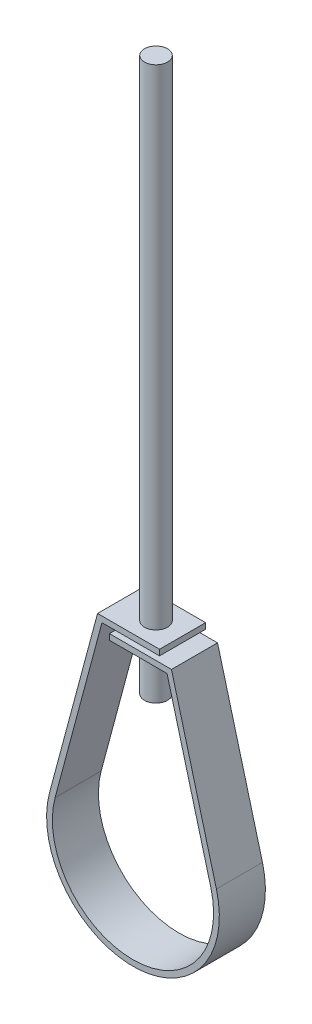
ISO-10303-21;
HEADER;
FILE_DESCRIPTION(('STEP AP214'),'2;1');
FILE_NAME('part.step','',(''),(''),'','','');
FILE_SCHEMA(('AUTOMOTIVE_DESIGN { 1 0 10303 214 1 1 1 1 }'));
ENDSEC;
DATA;
#1=APPLICATION_CONTEXT('core data for automotive mechanical design processes');
#2=APPLICATION_PROTOCOL_DEFINITION('international standard','automotive_design',2000,#1);
#3=PRODUCT_CONTEXT('',#1,'mechanical');
#4=PRODUCT('Part','Part','',(#3));
#5=PRODUCT_RELATED_PRODUCT_CATEGORY('part','',(#4));
#6=PRODUCT_DEFINITION_FORMATION('','',#4);
#7=PRODUCT_DEFINITION_CONTEXT('part definition',#1,'design');
#8=PRODUCT_DEFINITION('design','',#6,#7);
#9=PRODUCT_DEFINITION_SHAPE('','',#8);
#10=(LENGTH_UNIT() NAMED_UNIT(*) SI_UNIT(.MILLI.,.METRE.));
#11=(NAMED_UNIT(*) PLANE_ANGLE_UNIT() SI_UNIT($,.RADIAN.));
#12=(NAMED_UNIT(*) SI_UNIT($,.STERADIAN.) SOLID_ANGLE_UNIT());
#13=UNCERTAINTY_MEASURE_WITH_UNIT(LENGTH_MEASURE(1.E-05),#10,'distance_accuracy_value','');
#14=(GEOMETRIC_REPRESENTATION_CONTEXT(3) GLOBAL_UNCERTAINTY_ASSIGNED_CONTEXT((#13)) GLOBAL_UNIT_ASSIGNED_CONTEXT((#10,
#11,#12)) REPRESENTATION_CONTEXT('',''));
#15=CARTESIAN_POINT('',(0.,0.,0.));
#16=DIRECTION('',(0.,0.,1.));
#17=DIRECTION('',(1.,0.,0.));
#18=AXIS2_PLACEMENT_3D('',#15,#16,#17);
#19=CARTESIAN_POINT('',(-17.0929108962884,107.95,12.7));
#20=DIRECTION('',(0.,1.,0.));
#21=DIRECTION('',(0.,0.,1.));
#22=AXIS2_PLACEMENT_3D('',#19,#20,#21);
#23=PLANE('',#22);
#24=DIRECTION('',(1.,0.,0.));
#25=VECTOR('',#24,1.);
#26=CARTESIAN_POINT('',(-17.0929108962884,107.95,-12.7));
#27=LINE('',#26,#25);
#28=CARTESIAN_POINT('',(-17.0929108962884,107.95,-12.7));
#29=VERTEX_POINT('',#28);
#30=CARTESIAN_POINT('',(14.6570891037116,107.95,-12.7));
#31=VERTEX_POINT('',#30);
#32=EDGE_CURVE('E154',#29,#31,#27,.T.);
#33=ORIENTED_EDGE('',*,*,#32,.T.);
#34=DIRECTION('',(0.,0.,-1.));
#35=VECTOR('',#34,1.);
#36=CARTESIAN_POINT('',(14.6570891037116,107.95,12.7));
#37=LINE('',#36,#35);
#38=CARTESIAN_POINT('',(14.6570891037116,107.95,12.7));
#39=VERTEX_POINT('',#38);
#40=EDGE_CURVE('E200',#39,#31,#37,.T.);
#41=ORIENTED_EDGE('',*,*,#40,.F.);
#42=DIRECTION('',(1.,0.,0.));
#43=VECTOR('',#42,1.);
#44=CARTESIAN_POINT('',(-17.0929108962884,107.95,12.7));
#45=LINE('',#44,#43);
#46=CARTESIAN_POINT('',(-17.0929108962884,107.95,12.7));
#47=VERTEX_POINT('',#46);
#48=EDGE_CURVE('E102',#47,#39,#45,.T.);
#49=ORIENTED_EDGE('',*,*,#48,.F.);
#50=DIRECTION('',(0.,0.,-1.));
#51=VECTOR('',#50,1.);
#52=CARTESIAN_POINT('',(-17.0929108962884,107.95,12.7));
#53=LINE('',#52,#51);
#54=EDGE_CURVE('E150',#47,#29,#53,.T.);
#55=ORIENTED_EDGE('',*,*,#54,.T.);
#56=EDGE_LOOP('',(#33,#41,#49,#55));
#57=FACE_BOUND('',#56,.T.);
#58=CARTESIAN_POINT('',(0.,107.95,0.));
#59=DIRECTION('',(0.,1.,0.));
#60=DIRECTION('',(0.,0.,1.));
#61=AXIS2_PLACEMENT_3D('',#58,#59,#60);
#62=CIRCLE('',#61,6.35);
#63=CARTESIAN_POINT('',(0.,107.95,6.35));
#64=VERTEX_POINT('',#63);
#65=EDGE_CURVE('E11',#64,#64,#62,.F.);
#66=ORIENTED_EDGE('',*,*,#65,.F.);
#67=EDGE_LOOP('',(#66));
#68=FACE_BOUND('',#67,.T.);
#69=ADVANCED_FACE('F32',(#57,#68),#23,.F.);
#70=CARTESIAN_POINT('',(-17.0929108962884,111.125,12.7));
#71=DIRECTION('',(0.,1.,0.));
#72=DIRECTION('',(0.,0.,1.));
#73=AXIS2_PLACEMENT_3D('',#70,#71,#72);
#74=PLANE('',#73);
#75=DIRECTION('',(1.,0.,0.));
#76=VECTOR('',#75,1.);
#77=CARTESIAN_POINT('',(-17.0929108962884,111.125,-12.7));
#78=LINE('',#77,#76);
#79=CARTESIAN_POINT('',(-19.5291740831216,111.125,-12.7));
#80=VERTEX_POINT('',#79);
#81=CARTESIAN_POINT('',(14.6570891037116,111.125,-12.7));
#82=VERTEX_POINT('',#81);
#83=EDGE_CURVE('E161',#80,#82,#78,.T.);
#84=ORIENTED_EDGE('',*,*,#83,.F.);
#85=DIRECTION('',(0.,0.,-1.));
#86=VECTOR('',#85,1.);
#87=CARTESIAN_POINT('',(-19.5291740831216,111.125,12.7));
#88=LINE('',#87,#86);
#89=CARTESIAN_POINT('',(-19.5291740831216,111.125,12.7));
#90=VERTEX_POINT('',#89);
#91=EDGE_CURVE('E197',#90,#80,#88,.T.);
#92=ORIENTED_EDGE('',*,*,#91,.F.);
#93=DIRECTION('',(1.,0.,0.));
#94=VECTOR('',#93,1.);
#95=CARTESIAN_POINT('',(-17.0929108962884,111.125,12.7));
#96=LINE('',#95,#94);
#97=CARTESIAN_POINT('',(14.6570891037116,111.125,12.7));
#98=VERTEX_POINT('',#97);
#99=EDGE_CURVE('E301',#90,#98,#96,.T.);
#100=ORIENTED_EDGE('',*,*,#99,.T.);
#101=DIRECTION('',(0.,0.,-1.));
#102=VECTOR('',#101,1.);
#103=CARTESIAN_POINT('',(14.6570891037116,111.125,12.7));
#104=LINE('',#103,#102);
#105=EDGE_CURVE('E199',#98,#82,#104,.T.);
#106=ORIENTED_EDGE('',*,*,#105,.T.);
#107=EDGE_LOOP('',(#84,#92,#100,#106));
#108=FACE_BOUND('',#107,.T.);
#109=CARTESIAN_POINT('',(0.,111.125,0.));
#110=DIRECTION('',(0.,1.,0.));
#111=DIRECTION('',(0.,0.,1.));
#112=AXIS2_PLACEMENT_3D('',#109,#110,#111);
#113=CIRCLE('',#112,6.35);
#114=CARTESIAN_POINT('',(0.,111.125,6.35));
#115=VERTEX_POINT('',#114);
#116=EDGE_CURVE('E158',#115,#115,#113,.F.);
#117=ORIENTED_EDGE('',*,*,#116,.T.);
#118=EDGE_LOOP('',(#117));
#119=FACE_BOUND('',#118,.T.);
#120=ADVANCED_FACE('F220',(#108,#119),#74,.T.);
#121=CARTESIAN_POINT('',(-12.9556117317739,104.775,12.7));
#122=DIRECTION('',(0.,1.,0.));
#123=DIRECTION('',(0.,0.,1.));
#124=AXIS2_PLACEMENT_3D('',#121,#122,#123);
#125=PLANE('',#124);
#126=DIRECTION('',(1.,0.,0.));
#127=VECTOR('',#126,1.);
#128=CARTESIAN_POINT('',(-12.9556117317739,104.775,-12.7));
#129=LINE('',#128,#127);
#130=CARTESIAN_POINT('',(-12.9556117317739,104.775,-12.7));
#131=VERTEX_POINT('',#130);
#132=CARTESIAN_POINT('',(21.2306514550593,104.775,-12.7));
#133=VERTEX_POINT('',#132);
#134=EDGE_CURVE('E173',#131,#133,#129,.T.);
#135=ORIENTED_EDGE('',*,*,#134,.F.);
#136=DIRECTION('',(0.,0.,-1.));
#137=VECTOR('',#136,1.);
#138=CARTESIAN_POINT('',(-12.9556117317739,104.775,12.7));
#139=LINE('',#138,#137);
#140=CARTESIAN_POINT('',(-12.9556117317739,104.775,12.7));
#141=VERTEX_POINT('',#140);
#142=EDGE_CURVE('E189',#141,#131,#139,.T.);
#143=ORIENTED_EDGE('',*,*,#142,.F.);
#144=DIRECTION('',(1.,0.,0.));
#145=VECTOR('',#144,1.);
#146=CARTESIAN_POINT('',(-12.9556117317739,104.775,12.7));
#147=LINE('',#146,#145);
#148=CARTESIAN_POINT('',(21.2306514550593,104.775,12.7));
#149=VERTEX_POINT('',#148);
#150=EDGE_CURVE('E299',#141,#149,#147,.T.);
#151=ORIENTED_EDGE('',*,*,#150,.T.);
#152=DIRECTION('',(0.,0.,-1.));
#153=VECTOR('',#152,1.);
#154=CARTESIAN_POINT('',(21.2306514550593,104.775,12.7));
#155=LINE('',#154,#153);
#156=EDGE_CURVE('E191',#149,#133,#155,.T.);
#157=ORIENTED_EDGE('',*,*,#156,.T.);
#158=EDGE_LOOP('',(#135,#143,#151,#157));
#159=FACE_BOUND('',#158,.T.);
#160=CARTESIAN_POINT('',(0.,104.775,0.));
#161=DIRECTION('',(0.,1.,0.));
#162=DIRECTION('',(0.,0.,1.));
#163=AXIS2_PLACEMENT_3D('',#160,#161,#162);
#164=CIRCLE('',#163,6.35);
#165=CARTESIAN_POINT('',(0.,104.775,6.35));
#166=VERTEX_POINT('',#165);
#167=EDGE_CURVE('E322',#166,#166,#164,.F.);
#168=ORIENTED_EDGE('',*,*,#167,.T.);
#169=EDGE_LOOP('',(#168));
#170=FACE_BOUND('',#169,.T.);
#171=ADVANCED_FACE('F212',(#159,#170),#125,.T.);
#172=CARTESIAN_POINT('',(-12.9556117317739,101.6,12.7));
#173=DIRECTION('',(0.,1.,0.));
#174=DIRECTION('',(0.,0.,1.));
#175=AXIS2_PLACEMENT_3D('',#172,#173,#174);
#176=PLANE('',#175);
#177=DIRECTION('',(1.,0.,0.));
#178=VECTOR('',#177,1.);
#179=CARTESIAN_POINT('',(-12.9556117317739,101.6,-12.7));
#180=LINE('',#179,#178);
#181=CARTESIAN_POINT('',(-12.9556117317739,101.6,-12.7));
#182=VERTEX_POINT('',#181);
#183=CARTESIAN_POINT('',(18.7943882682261,101.6,-12.7));
#184=VERTEX_POINT('',#183);
#185=EDGE_CURVE('E179',#182,#184,#180,.T.);
#186=ORIENTED_EDGE('',*,*,#185,.T.);
#187=DIRECTION('',(0.,0.,-1.));
#188=VECTOR('',#187,1.);
#189=CARTESIAN_POINT('',(18.7943882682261,101.6,12.7));
#190=LINE('',#189,#188);
#191=CARTESIAN_POINT('',(18.7943882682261,101.6,12.7));
#192=VERTEX_POINT('',#191);
#193=EDGE_CURVE('E145',#192,#184,#190,.T.);
#194=ORIENTED_EDGE('',*,*,#193,.F.);
#195=DIRECTION('',(1.,0.,0.));
#196=VECTOR('',#195,1.);
#197=CARTESIAN_POINT('',(-12.9556117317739,101.6,12.7));
#198=LINE('',#197,#196);
#199=CARTESIAN_POINT('',(-12.9556117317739,101.6,12.7));
#200=VERTEX_POINT('',#199);
#201=EDGE_CURVE('E136',#200,#192,#198,.T.);
#202=ORIENTED_EDGE('',*,*,#201,.F.);
#203=DIRECTION('',(0.,0.,-1.));
#204=VECTOR('',#203,1.);
#205=CARTESIAN_POINT('',(-12.9556117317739,101.6,12.7));
#206=LINE('',#205,#204);
#207=EDGE_CURVE('E187',#200,#182,#206,.T.);
#208=ORIENTED_EDGE('',*,*,#207,.T.);
#209=EDGE_LOOP('',(#186,#194,#202,#208));
#210=FACE_BOUND('',#209,.T.);
#211=CARTESIAN_POINT('',(0.,101.6,0.));
#212=DIRECTION('',(0.,1.,0.));
#213=DIRECTION('',(0.,0.,1.));
#214=AXIS2_PLACEMENT_3D('',#211,#212,#213);
#215=CIRCLE('',#214,6.35);
#216=CARTESIAN_POINT('',(0.,101.6,6.35));
#217=VERTEX_POINT('',#216);
#218=EDGE_CURVE('E35',#217,#217,#215,.F.);
#219=ORIENTED_EDGE('',*,*,#218,.F.);
#220=EDGE_LOOP('',(#219));
#221=FACE_BOUND('',#220,.T.);
#222=ADVANCED_FACE('F209',(#210,#221),#176,.F.);
#223=CARTESIAN_POINT('',(14.6570891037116,111.125,12.7));
#224=DIRECTION('',(1.,0.,0.));
#225=DIRECTION('',(0.,0.,-1.));
#226=AXIS2_PLACEMENT_3D('',#223,#224,#225);
#227=PLANE('',#226);
#228=DIRECTION('',(0.,-1.,0.));
#229=VECTOR('',#228,1.);
#230=CARTESIAN_POINT('',(14.6570891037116,111.125,-12.7));
#231=LINE('',#230,#229);
#232=EDGE_CURVE('E157',#82,#31,#231,.T.);
#233=ORIENTED_EDGE('',*,*,#232,.F.);
#234=ORIENTED_EDGE('',*,*,#105,.F.);
#235=DIRECTION('',(0.,-1.,0.));
#236=VECTOR('',#235,1.);
#237=CARTESIAN_POINT('',(14.6570891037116,111.125,12.7));
#238=LINE('',#237,#236);
#239=EDGE_CURVE('E313',#98,#39,#238,.T.);
#240=ORIENTED_EDGE('',*,*,#239,.T.);
#241=ORIENTED_EDGE('',*,*,#40,.T.);
#242=EDGE_LOOP('',(#233,#234,#240,#241));
#243=FACE_BOUND('',#242,.T.);
#244=ADVANCED_FACE('F211',(#243),#227,.T.);
#245=CARTESIAN_POINT('',(-46.0022174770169,12.3262570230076,12.7));
#246=DIRECTION('',(-0.965925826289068,0.258819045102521,0.));
#247=DIRECTION('',(-0.258819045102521,-0.965925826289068,0.));
#248=AXIS2_PLACEMENT_3D('',#245,#246,#247);
#249=PLANE('',#248);
#250=DIRECTION('',(0.258819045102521,0.965925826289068,0.));
#251=VECTOR('',#250,1.);
#252=CARTESIAN_POINT('',(-46.0022174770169,12.3262570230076,-12.7));
#253=LINE('',#252,#251);
#254=CARTESIAN_POINT('',(-46.0022174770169,12.3262570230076,-12.7));
#255=VERTEX_POINT('',#254);
#256=EDGE_CURVE('E164',#255,#80,#253,.T.);
#257=ORIENTED_EDGE('',*,*,#256,.F.);
#258=DIRECTION('',(0.,0.,-1.));
#259=VECTOR('',#258,1.);
#260=CARTESIAN_POINT('',(-46.0022174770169,12.3262570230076,12.7));
#261=LINE('',#260,#259);
#262=CARTESIAN_POINT('',(-46.0022174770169,12.3262570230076,12.7));
#263=VERTEX_POINT('',#262);
#264=EDGE_CURVE('E195',#263,#255,#261,.T.);
#265=ORIENTED_EDGE('',*,*,#264,.F.);
#266=DIRECTION('',(0.258819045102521,0.965925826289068,0.));
#267=VECTOR('',#266,1.);
#268=CARTESIAN_POINT('',(-46.0022174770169,12.3262570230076,12.7));
#269=LINE('',#268,#267);
#270=EDGE_CURVE('E297',#263,#90,#269,.T.);
#271=ORIENTED_EDGE('',*,*,#270,.T.);
#272=ORIENTED_EDGE('',*,*,#91,.T.);
#273=EDGE_LOOP('',(#257,#265,#271,#272));
#274=FACE_BOUND('',#273,.T.);
#275=ADVANCED_FACE('F219',(#274),#249,.T.);
#276=CARTESIAN_POINT('',(0.,0.,12.7));
#277=DIRECTION('',(0.,0.,-1.));
#278=DIRECTION('',(-1.,0.,0.));
#279=AXIS2_PLACEMENT_3D('',#276,#277,#278);
#280=CYLINDRICAL_SURFACE('',#279,47.625);
#281=CARTESIAN_POINT('',(0.,0.,-12.7));
#282=DIRECTION('',(0.,0.,1.));
#283=DIRECTION('',(1.,0.,0.));
#284=AXIS2_PLACEMENT_3D('',#281,#282,#283);
#285=CIRCLE('',#284,47.625);
#286=CARTESIAN_POINT('',(46.0022174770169,12.3262570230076,-12.7));
#287=VERTEX_POINT('',#286);
#288=EDGE_CURVE('E167',#287,#255,#285,.F.);
#289=ORIENTED_EDGE('',*,*,#288,.F.);
#290=DIRECTION('',(0.,0.,-1.));
#291=VECTOR('',#290,1.);
#292=CARTESIAN_POINT('',(46.0022174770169,12.3262570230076,12.7));
#293=LINE('',#292,#291);
#294=CARTESIAN_POINT('',(46.0022174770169,12.3262570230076,12.7));
#295=VERTEX_POINT('',#294);
#296=EDGE_CURVE('E193',#295,#287,#293,.T.);
#297=ORIENTED_EDGE('',*,*,#296,.F.);
#298=CARTESIAN_POINT('',(0.,0.,12.7));
#299=DIRECTION('',(0.,0.,1.));
#300=DIRECTION('',(1.,0.,0.));
#301=AXIS2_PLACEMENT_3D('',#298,#299,#300);
#302=CIRCLE('',#301,47.625);
#303=EDGE_CURVE('E293',#295,#263,#302,.F.);
#304=ORIENTED_EDGE('',*,*,#303,.T.);
#305=ORIENTED_EDGE('',*,*,#264,.T.);
#306=EDGE_LOOP('',(#289,#297,#304,#305));
#307=FACE_BOUND('',#306,.T.);
#308=ADVANCED_FACE('F273',(#307),#280,.T.);
#309=CARTESIAN_POINT('',(21.8612027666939,102.421750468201,12.7));
#310=DIRECTION('',(0.965925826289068,0.258819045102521,0.));
#311=DIRECTION('',(-0.258819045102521,0.965925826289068,0.));
#312=AXIS2_PLACEMENT_3D('',#309,#310,#311);
#313=PLANE('',#312);
#314=DIRECTION('',(0.258819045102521,-0.965925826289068,0.));
#315=VECTOR('',#314,1.);
#316=CARTESIAN_POINT('',(21.8612027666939,102.421750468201,-12.7));
#317=LINE('',#316,#315);
#318=EDGE_CURVE('E170',#133,#287,#317,.T.);
#319=ORIENTED_EDGE('',*,*,#318,.F.);
#320=ORIENTED_EDGE('',*,*,#156,.F.);
#321=DIRECTION('',(0.258819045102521,-0.965925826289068,0.));
#322=VECTOR('',#321,1.);
#323=CARTESIAN_POINT('',(21.8612027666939,102.421750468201,12.7));
#324=LINE('',#323,#322);
#325=EDGE_CURVE('E296',#149,#295,#324,.T.);
#326=ORIENTED_EDGE('',*,*,#325,.T.);
#327=ORIENTED_EDGE('',*,*,#296,.T.);
#328=EDGE_LOOP('',(#319,#320,#326,#327));
#329=FACE_BOUND('',#328,.T.);
#330=ADVANCED_FACE('F268',(#329),#313,.T.);
#331=CARTESIAN_POINT('',(-12.9556117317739,101.6,12.7));
#332=DIRECTION('',(-1.,0.,0.));
#333=DIRECTION('',(0.,0.,1.));
#334=AXIS2_PLACEMENT_3D('',#331,#332,#333);
#335=PLANE('',#334);
#336=DIRECTION('',(0.,1.,0.));
#337=VECTOR('',#336,1.);
#338=CARTESIAN_POINT('',(-12.9556117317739,101.6,-12.7));
#339=LINE('',#338,#337);
#340=EDGE_CURVE('E176',#182,#131,#339,.T.);
#341=ORIENTED_EDGE('',*,*,#340,.F.);
#342=ORIENTED_EDGE('',*,*,#207,.F.);
#343=DIRECTION('',(0.,1.,0.));
#344=VECTOR('',#343,1.);
#345=CARTESIAN_POINT('',(-12.9556117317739,101.6,12.7));
#346=LINE('',#345,#344);
#347=EDGE_CURVE('E307',#200,#141,#346,.T.);
#348=ORIENTED_EDGE('',*,*,#347,.T.);
#349=ORIENTED_EDGE('',*,*,#142,.T.);
#350=EDGE_LOOP('',(#341,#342,#348,#349));
#351=FACE_BOUND('',#350,.T.);
#352=ADVANCED_FACE('F264',(#351),#335,.T.);
#353=CARTESIAN_POINT('',(18.7943882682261,101.6,12.7));
#354=DIRECTION('',(0.965925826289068,0.258819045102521,0.));
#355=DIRECTION('',(-0.258819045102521,0.965925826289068,0.));
#356=AXIS2_PLACEMENT_3D('',#353,#354,#355);
#357=PLANE('',#356);
#358=DIRECTION('',(0.258819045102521,-0.965925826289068,0.));
#359=VECTOR('',#358,1.);
#360=CARTESIAN_POINT('',(18.7943882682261,101.6,-12.7));
#361=LINE('',#360,#359);
#362=CARTESIAN_POINT('',(42.9354029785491,11.5045065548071,-12.7));
#363=VERTEX_POINT('',#362);
#364=EDGE_CURVE('E144',#184,#363,#361,.T.);
#365=ORIENTED_EDGE('',*,*,#364,.T.);
#366=DIRECTION('',(0.,0.,-1.));
#367=VECTOR('',#366,1.);
#368=CARTESIAN_POINT('',(42.9354029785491,11.5045065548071,12.7));
#369=LINE('',#368,#367);
#370=CARTESIAN_POINT('',(42.9354029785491,11.5045065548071,12.7));
#371=VERTEX_POINT('',#370);
#372=EDGE_CURVE('E141',#371,#363,#369,.T.);
#373=ORIENTED_EDGE('',*,*,#372,.F.);
#374=DIRECTION('',(0.258819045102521,-0.965925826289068,0.));
#375=VECTOR('',#374,1.);
#376=CARTESIAN_POINT('',(18.7943882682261,101.6,12.7));
#377=LINE('',#376,#375);
#378=EDGE_CURVE('E129',#192,#371,#377,.T.);
#379=ORIENTED_EDGE('',*,*,#378,.F.);
#380=ORIENTED_EDGE('',*,*,#193,.T.);
#381=EDGE_LOOP('',(#365,#373,#379,#380));
#382=FACE_BOUND('',#381,.T.);
#383=ADVANCED_FACE('F142',(#382),#357,.F.);
#384=CARTESIAN_POINT('',(0.,0.,12.7));
#385=DIRECTION('',(0.,0.,-1.));
#386=DIRECTION('',(-1.,0.,0.));
#387=AXIS2_PLACEMENT_3D('',#384,#385,#386);
#388=CYLINDRICAL_SURFACE('',#387,44.45);
#389=CARTESIAN_POINT('',(0.,0.,-12.7));
#390=DIRECTION('',(0.,0.,-1.));
#391=DIRECTION('',(-1.,0.,0.));
#392=AXIS2_PLACEMENT_3D('',#389,#390,#391);
#393=CIRCLE('',#392,44.45);
#394=CARTESIAN_POINT('',(-42.9354029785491,11.5045065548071,-12.7));
#395=VERTEX_POINT('',#394);
#396=EDGE_CURVE('E90',#363,#395,#393,.T.);
#397=ORIENTED_EDGE('',*,*,#396,.T.);
#398=DIRECTION('',(0.,0.,-1.));
#399=VECTOR('',#398,1.);
#400=CARTESIAN_POINT('',(-42.9354029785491,11.5045065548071,12.7));
#401=LINE('',#400,#399);
#402=CARTESIAN_POINT('',(-42.9354029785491,11.5045065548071,12.7));
#403=VERTEX_POINT('',#402);
#404=EDGE_CURVE('E146',#403,#395,#401,.T.);
#405=ORIENTED_EDGE('',*,*,#404,.F.);
#406=CARTESIAN_POINT('',(0.,0.,12.7));
#407=DIRECTION('',(0.,0.,-1.));
#408=DIRECTION('',(-1.,0.,0.));
#409=AXIS2_PLACEMENT_3D('',#406,#407,#408);
#410=CIRCLE('',#409,44.45);
#411=EDGE_CURVE('E133',#371,#403,#410,.T.);
#412=ORIENTED_EDGE('',*,*,#411,.F.);
#413=ORIENTED_EDGE('',*,*,#372,.T.);
#414=EDGE_LOOP('',(#397,#405,#412,#413));
#415=FACE_BOUND('',#414,.T.);
#416=ADVANCED_FACE('F148',(#415),#388,.F.);
#417=CARTESIAN_POINT('',(-42.9354029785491,11.5045065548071,12.7));
#418=DIRECTION('',(-0.965925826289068,0.258819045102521,0.));
#419=DIRECTION('',(-0.258819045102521,-0.965925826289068,0.));
#420=AXIS2_PLACEMENT_3D('',#417,#418,#419);
#421=PLANE('',#420);
#422=DIRECTION('',(0.258819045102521,0.965925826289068,0.));
#423=VECTOR('',#422,1.);
#424=CARTESIAN_POINT('',(-42.9354029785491,11.5045065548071,-12.7));
#425=LINE('',#424,#423);
#426=EDGE_CURVE('E96',#395,#29,#425,.T.);
#427=ORIENTED_EDGE('',*,*,#426,.T.);
#428=ORIENTED_EDGE('',*,*,#54,.F.);
#429=DIRECTION('',(0.258819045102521,0.965925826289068,0.));
#430=VECTOR('',#429,1.);
#431=CARTESIAN_POINT('',(-42.9354029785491,11.5045065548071,12.7));
#432=LINE('',#431,#430);
#433=EDGE_CURVE('E49',#403,#47,#432,.T.);
#434=ORIENTED_EDGE('',*,*,#433,.F.);
#435=ORIENTED_EDGE('',*,*,#404,.T.);
#436=EDGE_LOOP('',(#427,#428,#434,#435));
#437=FACE_BOUND('',#436,.T.);
#438=ADVANCED_FACE('F256',(#437),#421,.F.);
#439=CARTESIAN_POINT('',(0.,0.,12.7));
#440=DIRECTION('',(0.,0.,1.));
#441=DIRECTION('',(1.,0.,0.));
#442=AXIS2_PLACEMENT_3D('',#439,#440,#441);
#443=PLANE('',#442);
#444=ORIENTED_EDGE('',*,*,#48,.T.);
#445=ORIENTED_EDGE('',*,*,#239,.F.);
#446=ORIENTED_EDGE('',*,*,#99,.F.);
#447=ORIENTED_EDGE('',*,*,#270,.F.);
#448=ORIENTED_EDGE('',*,*,#303,.F.);
#449=ORIENTED_EDGE('',*,*,#325,.F.);
#450=ORIENTED_EDGE('',*,*,#150,.F.);
#451=ORIENTED_EDGE('',*,*,#347,.F.);
#452=ORIENTED_EDGE('',*,*,#201,.T.);
#453=ORIENTED_EDGE('',*,*,#378,.T.);
#454=ORIENTED_EDGE('',*,*,#411,.T.);
#455=ORIENTED_EDGE('',*,*,#433,.T.);
#456=EDGE_LOOP('',(#444,#445,#446,#447,#448,#449,#450,#451,#452,#453,#454,#455));
#457=FACE_BOUND('',#456,.T.);
#458=ADVANCED_FACE('F131',(#457),#443,.T.);
#459=CARTESIAN_POINT('',(0.,0.,-12.7));
#460=DIRECTION('',(0.,0.,1.));
#461=DIRECTION('',(1.,0.,0.));
#462=AXIS2_PLACEMENT_3D('',#459,#460,#461);
#463=PLANE('',#462);
#464=ORIENTED_EDGE('',*,*,#32,.F.);
#465=ORIENTED_EDGE('',*,*,#426,.F.);
#466=ORIENTED_EDGE('',*,*,#396,.F.);
#467=ORIENTED_EDGE('',*,*,#364,.F.);
#468=ORIENTED_EDGE('',*,*,#185,.F.);
#469=ORIENTED_EDGE('',*,*,#340,.T.);
#470=ORIENTED_EDGE('',*,*,#134,.T.);
#471=ORIENTED_EDGE('',*,*,#318,.T.);
#472=ORIENTED_EDGE('',*,*,#288,.T.);
#473=ORIENTED_EDGE('',*,*,#256,.T.);
#474=ORIENTED_EDGE('',*,*,#83,.T.);
#475=ORIENTED_EDGE('',*,*,#232,.T.);
#476=EDGE_LOOP('',(#464,#465,#466,#467,#468,#469,#470,#471,#472,#473,#474,#475));
#477=FACE_BOUND('',#476,.T.);
#478=ADVANCED_FACE('F255',(#477),#463,.F.);
#479=CARTESIAN_POINT('',(0.,76.2,0.));
#480=DIRECTION('',(0.,1.,0.));
#481=DIRECTION('',(0.,0.,1.));
#482=AXIS2_PLACEMENT_3D('',#479,#480,#481);
#483=PLANE('',#482);
#484=CARTESIAN_POINT('',(0.,76.2,0.));
#485=DIRECTION('',(0.,1.,0.));
#486=DIRECTION('',(0.,0.,1.));
#487=AXIS2_PLACEMENT_3D('',#484,#485,#486);
#488=CIRCLE('',#487,6.35);
#489=CARTESIAN_POINT('',(0.,76.2,6.35));
#490=VERTEX_POINT('',#489);
#491=EDGE_CURVE('E328',#490,#490,#488,.T.);
#492=ORIENTED_EDGE('',*,*,#491,.F.);
#493=EDGE_LOOP('',(#492));
#494=FACE_BOUND('',#493,.T.);
#495=ADVANCED_FACE('F247',(#494),#483,.F.);
#496=CARTESIAN_POINT('',(0.,381.,0.));
#497=DIRECTION('',(0.,-1.,0.));
#498=DIRECTION('',(0.,0.,-1.));
#499=AXIS2_PLACEMENT_3D('',#496,#497,#498);
#500=CYLINDRICAL_SURFACE('',#499,6.35);
#501=ORIENTED_EDGE('',*,*,#491,.T.);
#502=EDGE_LOOP('',(#501));
#503=FACE_BOUND('',#502,.T.);
#504=ORIENTED_EDGE('',*,*,#218,.T.);
#505=EDGE_LOOP('',(#504));
#506=FACE_BOUND('',#505,.T.);
#507=ADVANCED_FACE('F207',(#503,#506),#500,.T.);
#508=ORIENTED_EDGE('',*,*,#167,.F.);
#509=EDGE_LOOP('',(#508));
#510=FACE_BOUND('',#509,.T.);
#511=ORIENTED_EDGE('',*,*,#65,.T.);
#512=EDGE_LOOP('',(#511));
#513=FACE_BOUND('',#512,.T.);
#514=ADVANCED_FACE('F236',(#510,#513),#500,.T.);
#515=ORIENTED_EDGE('',*,*,#116,.F.);
#516=EDGE_LOOP('',(#515));
#517=FACE_BOUND('',#516,.T.);
#518=CARTESIAN_POINT('',(0.,381.,0.));
#519=DIRECTION('',(0.,1.,0.));
#520=DIRECTION('',(0.,0.,1.));
#521=AXIS2_PLACEMENT_3D('',#518,#519,#520);
#522=CIRCLE('',#521,6.35);
#523=CARTESIAN_POINT('',(0.,381.,6.35));
#524=VERTEX_POINT('',#523);
#525=EDGE_CURVE('E325',#524,#524,#522,.T.);
#526=ORIENTED_EDGE('',*,*,#525,.F.);
#527=EDGE_LOOP('',(#526));
#528=FACE_BOUND('',#527,.T.);
#529=ADVANCED_FACE('F238',(#517,#528),#500,.T.);
#530=CARTESIAN_POINT('',(0.,381.,0.));
#531=DIRECTION('',(0.,1.,0.));
#532=DIRECTION('',(0.,0.,1.));
#533=AXIS2_PLACEMENT_3D('',#530,#531,#532);
#534=PLANE('',#533);
#535=ORIENTED_EDGE('',*,*,#525,.T.);
#536=EDGE_LOOP('',(#535));
#537=FACE_BOUND('',#536,.T.);
#538=ADVANCED_FACE('F245',(#537),#534,.T.);
#539=CLOSED_SHELL('',(#69,#120,#171,#222,#244,#275,#308,#330,#352,#383,#416,#438,#458,#478,#495,
#507,#514,#529,#538));
#540=MANIFOLD_SOLID_BREP('B2',#539);
#541=ADVANCED_BREP_SHAPE_REPRESENTATION('',(#18,#540),#14);
#542=SHAPE_DEFINITION_REPRESENTATION(#9,#541);
ENDSEC;
END-ISO-10303-21;
